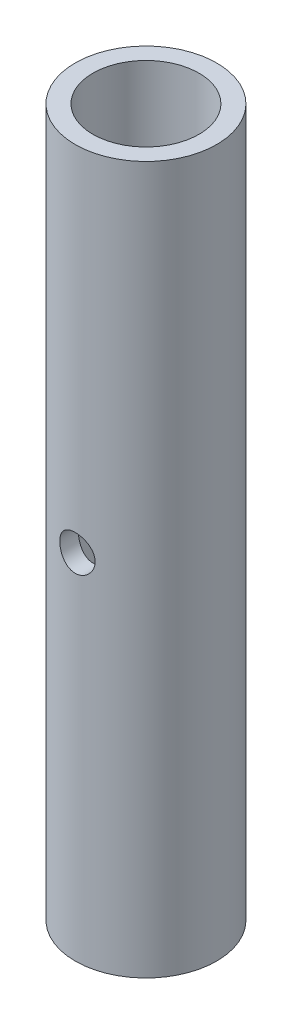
from build123d import *

# Parameters (mm, degrees)
SKETCH2_R               = 25.4
SKETCH2_R_2             = 19.05
BOSS_EXTRUDE1_DEPTH     = 254
CUT_EXTRUDE1_DEPTH      = 257.527425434
CUT_EXTRUDE1_DEPTH_BACK = 257.527425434
SKETCH3_R               = 6.35


with BuildPart() as part:
    # Sketch2 → Boss-Extrude1 (new body)
    with BuildSketch(Plane(origin=(0, 0, 0), x_dir=(1, 0, 0), z_dir=(0, 1, 0))):
        with Locations(Location((0, 0, 0), (0, 0, 270))):
            Circle(SKETCH2_R)
        with Locations(Location((0, 0, 0), (0, 0, 270))):
            Circle(SKETCH2_R_2, mode=Mode.SUBTRACT)
    extrude(amount=BOSS_EXTRUDE1_DEPTH)

    # Sketch3 → Cut-Extrude1 (cut, two sides: drawn at the far end of the back side and taken through both)
    with BuildSketch(Plane.XY.offset(-CUT_EXTRUDE1_DEPTH_BACK)):
        with Locations((0, 127)):
            Circle(SKETCH3_R)
    extrude(amount=CUT_EXTRUDE1_DEPTH + CUT_EXTRUDE1_DEPTH_BACK, mode=Mode.SUBTRACT)


solid = part.part
